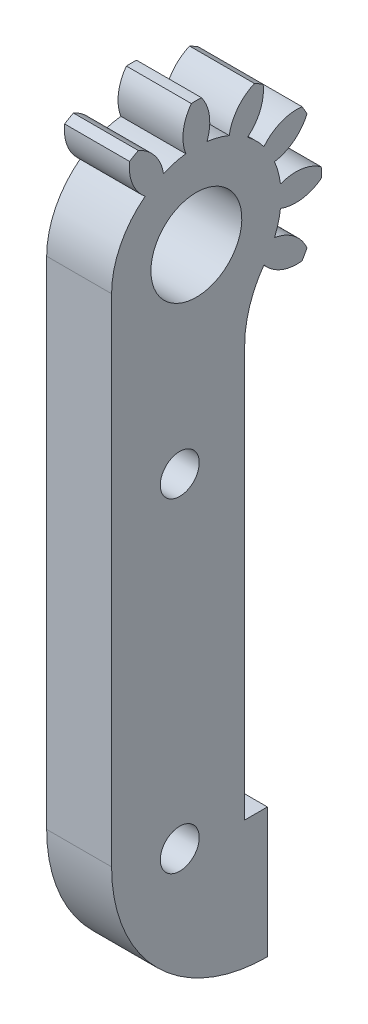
ISO-10303-21;
HEADER;
FILE_DESCRIPTION(('STEP AP214'),'2;1');
FILE_NAME('part.step','',(''),(''),'','','');
FILE_SCHEMA(('AUTOMOTIVE_DESIGN { 1 0 10303 214 1 1 1 1 }'));
ENDSEC;
DATA;
#1=APPLICATION_CONTEXT('core data for automotive mechanical design processes');
#2=APPLICATION_PROTOCOL_DEFINITION('international standard','automotive_design',2000,#1);
#3=PRODUCT_CONTEXT('',#1,'mechanical');
#4=PRODUCT('Part','Part','',(#3));
#5=PRODUCT_RELATED_PRODUCT_CATEGORY('part','',(#4));
#6=PRODUCT_DEFINITION_FORMATION('','',#4);
#7=PRODUCT_DEFINITION_CONTEXT('part definition',#1,'design');
#8=PRODUCT_DEFINITION('design','',#6,#7);
#9=PRODUCT_DEFINITION_SHAPE('','',#8);
#10=(LENGTH_UNIT() NAMED_UNIT(*) SI_UNIT(.MILLI.,.METRE.));
#11=(NAMED_UNIT(*) PLANE_ANGLE_UNIT() SI_UNIT($,.RADIAN.));
#12=(NAMED_UNIT(*) SI_UNIT($,.STERADIAN.) SOLID_ANGLE_UNIT());
#13=UNCERTAINTY_MEASURE_WITH_UNIT(LENGTH_MEASURE(1.E-05),#10,'distance_accuracy_value','');
#14=(GEOMETRIC_REPRESENTATION_CONTEXT(3) GLOBAL_UNCERTAINTY_ASSIGNED_CONTEXT((#13)) GLOBAL_UNIT_ASSIGNED_CONTEXT((#10,
#11,#12)) REPRESENTATION_CONTEXT('',''));
#15=CARTESIAN_POINT('',(0.,0.,0.));
#16=DIRECTION('',(0.,0.,1.));
#17=DIRECTION('',(1.,0.,0.));
#18=AXIS2_PLACEMENT_3D('',#15,#16,#17);
#19=CARTESIAN_POINT('',(2.81611238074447,0.23012666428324,-0.226197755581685));
#20=DIRECTION('',(-1.,0.,0.));
#21=DIRECTION('',(0.,-0.258819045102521,0.965925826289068));
#22=AXIS2_PLACEMENT_3D('',#19,#20,#21);
#23=CYLINDRICAL_SURFACE('',#22,6.53025);
#24=CARTESIAN_POINT('',(-2.18388761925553,0.23012666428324,-0.226197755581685));
#25=DIRECTION('',(-1.,0.,0.));
#26=DIRECTION('',(0.,0.707106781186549,-0.707106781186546));
#27=AXIS2_PLACEMENT_3D('',#24,#25,#26);
#28=CIRCLE('',#27,6.53025);
#29=CARTESIAN_POINT('',(-2.18388761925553,0.230126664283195,6.30405224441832));
#30=VERTEX_POINT('',#29);
#31=CARTESIAN_POINT('',(-2.18388761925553,5.43320069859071,3.71996312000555));
#32=VERTEX_POINT('',#31);
#33=EDGE_CURVE('E251',#30,#32,#28,.T.);
#34=ORIENTED_EDGE('',*,*,#33,.F.);
#35=DIRECTION('',(1.,0.,0.));
#36=VECTOR('',#35,1.);
#37=CARTESIAN_POINT('',(-53.8275283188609,0.230126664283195,6.30405224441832));
#38=LINE('',#37,#36);
#39=CARTESIAN_POINT('',(2.81611238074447,0.230126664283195,6.30405224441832));
#40=VERTEX_POINT('',#39);
#41=EDGE_CURVE('E236',#30,#40,#38,.T.);
#42=ORIENTED_EDGE('',*,*,#41,.T.);
#43=CARTESIAN_POINT('',(2.81611238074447,0.23012666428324,-0.226197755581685));
#44=DIRECTION('',(-1.,0.,0.));
#45=DIRECTION('',(0.,0.707106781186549,-0.707106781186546));
#46=AXIS2_PLACEMENT_3D('',#43,#44,#45);
#47=CIRCLE('',#46,6.53025);
#48=CARTESIAN_POINT('',(2.81611238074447,5.43320069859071,3.71996312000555));
#49=VERTEX_POINT('',#48);
#50=EDGE_CURVE('E249',#40,#49,#47,.T.);
#51=ORIENTED_EDGE('',*,*,#50,.T.);
#52=DIRECTION('',(-1.,0.,0.));
#53=VECTOR('',#52,1.);
#54=CARTESIAN_POINT('',(2.81611238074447,5.43320069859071,3.71996312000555));
#55=LINE('',#54,#53);
#56=EDGE_CURVE('E257',#49,#32,#55,.T.);
#57=ORIENTED_EDGE('',*,*,#56,.T.);
#58=EDGE_LOOP('',(#34,#42,#51,#57));
#59=FACE_BOUND('',#58,.T.);
#60=ADVANCED_FACE('F33',(#59),#23,.T.);
#61=CARTESIAN_POINT('',(2.81611238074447,0.23012666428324,-0.226197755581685));
#62=DIRECTION('',(-1.,0.,0.));
#63=DIRECTION('',(0.,-0.258819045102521,0.965925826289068));
#64=AXIS2_PLACEMENT_3D('',#61,#62,#63);
#65=PLANE('',#64);
#66=CARTESIAN_POINT('',(2.81611238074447,-14.4107973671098,1.05405224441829));
#67=DIRECTION('',(-1.,0.,0.));
#68=DIRECTION('',(0.,0.,1.));
#69=AXIS2_PLACEMENT_3D('',#66,#67,#68);
#70=CIRCLE('',#69,1.50000000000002);
#71=CARTESIAN_POINT('',(2.81611238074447,-14.4107973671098,2.55405224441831));
#72=VERTEX_POINT('',#71);
#73=EDGE_CURVE('E822',#72,#72,#70,.F.);
#74=ORIENTED_EDGE('',*,*,#73,.F.);
#75=EDGE_LOOP('',(#74));
#76=FACE_BOUND('',#75,.T.);
#77=CARTESIAN_POINT('',(2.81611238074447,-39.4107973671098,1.05405224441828));
#78=DIRECTION('',(-1.,0.,0.));
#79=DIRECTION('',(0.,0.,1.));
#80=AXIS2_PLACEMENT_3D('',#77,#78,#79);
#81=CIRCLE('',#80,1.50000000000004);
#82=CARTESIAN_POINT('',(2.81611238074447,-39.4107973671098,2.55405224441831));
#83=VERTEX_POINT('',#82);
#84=EDGE_CURVE('E245',#83,#83,#81,.F.);
#85=ORIENTED_EDGE('',*,*,#84,.F.);
#86=EDGE_LOOP('',(#85));
#87=FACE_BOUND('',#86,.T.);
#88=CARTESIAN_POINT('',(2.81611238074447,0.23012666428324,-0.226197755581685));
#89=DIRECTION('',(-1.,0.,0.));
#90=DIRECTION('',(0.,-0.258819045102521,0.965925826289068));
#91=AXIS2_PLACEMENT_3D('',#88,#89,#90);
#92=CIRCLE('',#91,3.5);
#93=CARTESIAN_POINT('',(2.81611238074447,-0.675739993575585,3.15454263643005));
#94=VERTEX_POINT('',#93);
#95=EDGE_CURVE('E449',#94,#94,#92,.F.);
#96=ORIENTED_EDGE('',*,*,#95,.F.);
#97=EDGE_LOOP('',(#96));
#98=FACE_BOUND('',#97,.T.);
#99=ORIENTED_EDGE('',*,*,#50,.F.);
#100=DIRECTION('',(0.,-1.,0.));
#101=VECTOR('',#100,1.);
#102=CARTESIAN_POINT('',(2.81611238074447,0.230126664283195,6.30405224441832));
#103=LINE('',#102,#101);
#104=CARTESIAN_POINT('',(2.81611238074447,-38.,6.30405224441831));
#105=VERTEX_POINT('',#104);
#106=EDGE_CURVE('E232',#40,#105,#103,.T.);
#107=ORIENTED_EDGE('',*,*,#106,.T.);
#108=CARTESIAN_POINT('',(2.81611238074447,-38.,-5.69594775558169));
#109=DIRECTION('',(1.,0.,0.));
#110=DIRECTION('',(0.,0.,-1.));
#111=AXIS2_PLACEMENT_3D('',#108,#109,#110);
#112=CIRCLE('',#111,12.);
#113=CARTESIAN_POINT('',(2.81611238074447,-50.,-5.69594775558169));
#114=VERTEX_POINT('',#113);
#115=EDGE_CURVE('E244',#105,#114,#112,.T.);
#116=ORIENTED_EDGE('',*,*,#115,.T.);
#117=DIRECTION('',(0.,1.,0.));
#118=VECTOR('',#117,1.);
#119=CARTESIAN_POINT('',(2.81611238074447,-40.,-5.69594775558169));
#120=LINE('',#119,#118);
#121=CARTESIAN_POINT('',(2.81611238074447,-40.,-5.69594775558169));
#122=VERTEX_POINT('',#121);
#123=EDGE_CURVE('E839',#114,#122,#120,.T.);
#124=ORIENTED_EDGE('',*,*,#123,.T.);
#125=DIRECTION('',(0.,0.,1.));
#126=VECTOR('',#125,1.);
#127=CARTESIAN_POINT('',(2.81611238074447,-40.,-3.94594775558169));
#128=LINE('',#127,#126);
#129=CARTESIAN_POINT('',(2.81611238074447,-40.,-3.94594775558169));
#130=VERTEX_POINT('',#129);
#131=EDGE_CURVE('E842',#122,#130,#128,.T.);
#132=ORIENTED_EDGE('',*,*,#131,.T.);
#133=DIRECTION('',(0.,1.,0.));
#134=VECTOR('',#133,1.);
#135=CARTESIAN_POINT('',(2.81611238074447,-40.,-3.94594775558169));
#136=LINE('',#135,#134);
#137=CARTESIAN_POINT('',(2.81611238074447,-8.35639350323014,-3.94594775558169));
#138=VERTEX_POINT('',#137);
#139=EDGE_CURVE('E845',#130,#138,#136,.T.);
#140=ORIENTED_EDGE('',*,*,#139,.T.);
#141=CARTESIAN_POINT('',(2.81611238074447,-8.35639350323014,-11.9459477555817));
#142=DIRECTION('',(-1.,0.,0.));
#143=DIRECTION('',(0.,0.,1.));
#144=AXIS2_PLACEMENT_3D('',#141,#142,#143);
#145=CIRCLE('',#144,8.);
#146=CARTESIAN_POINT('',(2.81611238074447,-3.71603421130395,-5.42927178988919));
#147=VERTEX_POINT('',#146);
#148=EDGE_CURVE('E252',#138,#147,#145,.T.);
#149=ORIENTED_EDGE('',*,*,#148,.T.);
#150=CARTESIAN_POINT('',(2.81611238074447,-1.63710295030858,-7.99209148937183));
#151=DIRECTION('',(-1.,0.,0.));
#152=DIRECTION('',(0.,-0.707106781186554,0.707106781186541));
#153=AXIS2_PLACEMENT_3D('',#150,#151,#152);
#154=CIRCLE('',#153,3.3);
#155=CARTESIAN_POINT('',(2.81611238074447,-4.91657616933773,-8.35959034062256));
#156=VERTEX_POINT('',#155);
#157=EDGE_CURVE('E374',#156,#147,#154,.T.);
#158=ORIENTED_EDGE('',*,*,#157,.F.);
#159=CARTESIAN_POINT('',(2.81611238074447,0.23012666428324,-0.226197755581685));
#160=DIRECTION('',(-1.,0.,0.));
#161=DIRECTION('',(0.,-0.258819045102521,0.965925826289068));
#162=AXIS2_PLACEMENT_3D('',#159,#160,#161);
#163=CIRCLE('',#162,9.625);
#164=CARTESIAN_POINT('',(2.81611238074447,-4.2402465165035,-8.75006944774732));
#165=VERTEX_POINT('',#164);
#166=EDGE_CURVE('E304',#165,#156,#163,.T.);
#167=ORIENTED_EDGE('',*,*,#166,.F.);
#168=CARTESIAN_POINT('',(2.81611238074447,-5.56171978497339,-5.72621290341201));
#169=DIRECTION('',(-1.,0.,0.));
#170=DIRECTION('',(0.,-0.965925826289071,0.258819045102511));
#171=AXIS2_PLACEMENT_3D('',#168,#169,#170);
#172=CIRCLE('',#171,3.3);
#173=CARTESIAN_POINT('',(2.81611238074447,-2.30278718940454,-6.24521033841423));
#174=VERTEX_POINT('',#173);
#175=EDGE_CURVE('E371',#174,#165,#172,.T.);
#176=ORIENTED_EDGE('',*,*,#175,.F.);
#177=CARTESIAN_POINT('',(2.81611238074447,0.23012666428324,-0.226197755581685));
#178=DIRECTION('',(-1.,0.,0.));
#179=DIRECTION('',(0.,-0.965925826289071,0.258819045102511));
#180=AXIS2_PLACEMENT_3D('',#177,#178,#179);
#181=CIRCLE('',#180,6.53025);
#182=CARTESIAN_POINT('',(2.81611238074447,-0.585811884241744,-6.70527248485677));
#183=VERTEX_POINT('',#182);
#184=EDGE_CURVE('E461',#183,#174,#181,.T.);
#185=ORIENTED_EDGE('',*,*,#184,.F.);
#186=CARTESIAN_POINT('',(2.81611238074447,2.49600525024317,-7.88527381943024));
#187=DIRECTION('',(-1.,0.,0.));
#188=DIRECTION('',(0.,-0.965925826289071,0.258819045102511));
#189=AXIS2_PLACEMENT_3D('',#186,#187,#188);
#190=CIRCLE('',#189,3.3);
#191=CARTESIAN_POINT('',(2.81611238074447,-0.160352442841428,-9.84327376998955));
#192=VERTEX_POINT('',#191);
#193=EDGE_CURVE('E458',#192,#183,#190,.T.);
#194=ORIENTED_EDGE('',*,*,#193,.F.);
#195=CARTESIAN_POINT('',(2.81611238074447,0.62060577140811,-9.84327376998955));
#196=VERTEX_POINT('',#195);
#197=EDGE_CURVE('E375',#196,#192,#163,.T.);
#198=ORIENTED_EDGE('',*,*,#197,.F.);
#199=CARTESIAN_POINT('',(2.81611238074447,-2.03575192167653,-7.88527381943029));
#200=DIRECTION('',(-1.,0.,0.));
#201=DIRECTION('',(0.,-0.965925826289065,-0.258819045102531));
#202=AXIS2_PLACEMENT_3D('',#199,#200,#201);
#203=CIRCLE('',#202,3.3);
#204=CARTESIAN_POINT('',(2.81611238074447,1.04606521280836,-6.70527248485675));
#205=VERTEX_POINT('',#204);
#206=EDGE_CURVE('E472',#205,#196,#203,.T.);
#207=ORIENTED_EDGE('',*,*,#206,.F.);
#208=CARTESIAN_POINT('',(2.81611238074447,0.23012666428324,-0.226197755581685));
#209=DIRECTION('',(-1.,0.,0.));
#210=DIRECTION('',(0.,-0.965925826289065,-0.258819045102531));
#211=AXIS2_PLACEMENT_3D('',#208,#209,#210);
#212=CIRCLE('',#211,6.53025);
#213=CARTESIAN_POINT('',(2.81611238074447,2.76304051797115,-6.24521033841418));
#214=VERTEX_POINT('',#213);
#215=EDGE_CURVE('E477',#214,#205,#212,.T.);
#216=ORIENTED_EDGE('',*,*,#215,.F.);
#217=CARTESIAN_POINT('',(2.81611238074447,6.02197311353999,-5.72621290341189));
#218=DIRECTION('',(-1.,0.,0.));
#219=DIRECTION('',(0.,-0.965925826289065,-0.258819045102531));
#220=AXIS2_PLACEMENT_3D('',#217,#218,#219);
#221=CIRCLE('',#220,3.3);
#222=CARTESIAN_POINT('',(2.81611238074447,4.70049984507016,-8.75006944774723));
#223=VERTEX_POINT('',#222);
#224=EDGE_CURVE('E474',#223,#214,#221,.T.);
#225=ORIENTED_EDGE('',*,*,#224,.F.);
#226=CARTESIAN_POINT('',(2.81611238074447,5.37682949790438,-8.35959034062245));
#227=VERTEX_POINT('',#226);
#228=EDGE_CURVE('E359',#227,#223,#163,.T.);
#229=ORIENTED_EDGE('',*,*,#228,.F.);
#230=CARTESIAN_POINT('',(2.81611238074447,2.09735627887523,-7.99209148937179));
#231=DIRECTION('',(-1.,0.,0.));
#232=DIRECTION('',(0.,-0.707106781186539,-0.707106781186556));
#233=AXIS2_PLACEMENT_3D('',#230,#231,#232);
#234=CIRCLE('',#233,3.3);
#235=CARTESIAN_POINT('',(2.81611238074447,4.17628753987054,-5.42927178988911));
#236=VERTEX_POINT('',#235);
#237=EDGE_CURVE('E397',#236,#227,#234,.T.);
#238=ORIENTED_EDGE('',*,*,#237,.F.);
#239=CARTESIAN_POINT('',(2.81611238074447,0.23012666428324,-0.226197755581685));
#240=DIRECTION('',(-1.,0.,0.));
#241=DIRECTION('',(0.,-0.707106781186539,-0.707106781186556));
#242=AXIS2_PLACEMENT_3D('',#239,#240,#241);
#243=CIRCLE('',#242,6.53025);
#244=CARTESIAN_POINT('',(2.81611238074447,5.43320069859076,-4.17235863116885));
#245=VERTEX_POINT('',#244);
#246=EDGE_CURVE('E394',#245,#236,#243,.T.);
#247=ORIENTED_EDGE('',*,*,#246,.F.);
#248=CARTESIAN_POINT('',(2.81611238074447,7.99602039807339,-2.09342737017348));
#249=DIRECTION('',(-1.,0.,0.));
#250=DIRECTION('',(0.,-0.707106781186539,-0.707106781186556));
#251=AXIS2_PLACEMENT_3D('',#248,#249,#250);
#252=CIRCLE('',#251,3.3);
#253=CARTESIAN_POINT('',(2.81611238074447,8.36351924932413,-5.37290058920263));
#254=VERTEX_POINT('',#253);
#255=EDGE_CURVE('E392',#254,#245,#252,.T.);
#256=ORIENTED_EDGE('',*,*,#255,.F.);
#257=CARTESIAN_POINT('',(2.81611238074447,8.75399835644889,-4.69657093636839));
#258=VERTEX_POINT('',#257);
#259=EDGE_CURVE('E303',#258,#254,#163,.T.);
#260=ORIENTED_EDGE('',*,*,#259,.F.);
#261=CARTESIAN_POINT('',(2.81611238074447,5.73014181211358,-6.0180442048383));
#262=DIRECTION('',(-1.,0.,0.));
#263=DIRECTION('',(0.,-0.258819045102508,-0.965925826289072));
#264=AXIS2_PLACEMENT_3D('',#261,#262,#263);
#265=CIRCLE('',#264,3.3);
#266=CARTESIAN_POINT('',(2.81611238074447,6.2491392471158,-2.75911160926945));
#267=VERTEX_POINT('',#266);
#268=EDGE_CURVE('E390',#267,#258,#265,.T.);
#269=ORIENTED_EDGE('',*,*,#268,.F.);
#270=CARTESIAN_POINT('',(2.81611238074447,0.23012666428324,-0.226197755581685));
#271=DIRECTION('',(-1.,0.,0.));
#272=DIRECTION('',(0.,-0.258819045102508,-0.965925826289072));
#273=AXIS2_PLACEMENT_3D('',#270,#271,#272);
#274=CIRCLE('',#273,6.53025);
#275=CARTESIAN_POINT('',(2.81611238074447,6.70920139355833,-1.04213630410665));
#276=VERTEX_POINT('',#275);
#277=EDGE_CURVE('E424',#276,#267,#274,.T.);
#278=ORIENTED_EDGE('',*,*,#277,.F.);
#279=CARTESIAN_POINT('',(2.81611238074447,7.88920272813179,2.03968083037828));
#280=DIRECTION('',(-1.,0.,0.));
#281=DIRECTION('',(0.,-0.258819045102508,-0.965925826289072));
#282=AXIS2_PLACEMENT_3D('',#279,#280,#281);
#283=CIRCLE('',#282,3.3);
#284=CARTESIAN_POINT('',(2.81611238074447,9.84720267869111,-0.616676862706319));
#285=VERTEX_POINT('',#284);
#286=EDGE_CURVE('E417',#285,#276,#283,.T.);
#287=ORIENTED_EDGE('',*,*,#286,.F.);
#288=CARTESIAN_POINT('',(2.81611238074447,9.8472026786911,0.164281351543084));
#289=VERTEX_POINT('',#288);
#290=EDGE_CURVE('E299',#289,#285,#163,.T.);
#291=ORIENTED_EDGE('',*,*,#290,.F.);
#292=CARTESIAN_POINT('',(2.81611238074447,7.88920272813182,-2.49207634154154));
#293=DIRECTION('',(-1.,0.,0.));
#294=DIRECTION('',(0.,0.258819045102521,-0.965925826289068));
#295=AXIS2_PLACEMENT_3D('',#292,#293,#294);
#296=CIRCLE('',#295,3.3);
#297=CARTESIAN_POINT('',(2.81611238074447,6.70920139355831,0.589740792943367));
#298=VERTEX_POINT('',#297);
#299=EDGE_CURVE('E271',#298,#289,#296,.T.);
#300=ORIENTED_EDGE('',*,*,#299,.F.);
#301=CARTESIAN_POINT('',(2.81611238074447,0.23012666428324,-0.226197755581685));
#302=DIRECTION('',(-1.,0.,0.));
#303=DIRECTION('',(0.,0.258819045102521,-0.965925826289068));
#304=AXIS2_PLACEMENT_3D('',#301,#302,#303);
#305=CIRCLE('',#304,6.53025);
#306=CARTESIAN_POINT('',(2.81611238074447,6.24913924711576,2.30671609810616));
#307=VERTEX_POINT('',#306);
#308=EDGE_CURVE('E276',#307,#298,#305,.T.);
#309=ORIENTED_EDGE('',*,*,#308,.F.);
#310=CARTESIAN_POINT('',(2.81611238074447,5.7301418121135,5.56564869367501));
#311=DIRECTION('',(-1.,0.,0.));
#312=DIRECTION('',(0.,0.258819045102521,-0.965925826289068));
#313=AXIS2_PLACEMENT_3D('',#310,#311,#312);
#314=CIRCLE('',#313,3.3);
#315=CARTESIAN_POINT('',(2.81611238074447,8.75399835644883,4.24417542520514));
#316=VERTEX_POINT('',#315);
#317=EDGE_CURVE('E273',#316,#307,#314,.T.);
#318=ORIENTED_EDGE('',*,*,#317,.F.);
#319=CARTESIAN_POINT('',(2.81611238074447,8.36351924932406,4.92050507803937));
#320=VERTEX_POINT('',#319);
#321=EDGE_CURVE('E296',#320,#316,#163,.T.);
#322=ORIENTED_EDGE('',*,*,#321,.F.);
#323=CARTESIAN_POINT('',(2.81611238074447,7.99602039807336,1.64103185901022));
#324=DIRECTION('',(-1.,0.,0.));
#325=DIRECTION('',(0.,0.707106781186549,-0.707106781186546));
#326=AXIS2_PLACEMENT_3D('',#323,#324,#325);
#327=CIRCLE('',#326,3.3);
#328=EDGE_CURVE('E256',#49,#320,#327,.T.);
#329=ORIENTED_EDGE('',*,*,#328,.F.);
#330=EDGE_LOOP('',(#99,#107,#116,#124,#132,#140,#149,#158,#167,#176,#185,#194,#198,#207,#216,
#225,#229,#238,#247,#256,#260,#269,#278,#287,#291,#300,#309,#318,#322,#329));
#331=FACE_BOUND('',#330,.T.);
#332=ADVANCED_FACE('F35',(#76,#87,#98,#331),#65,.F.);
#333=CARTESIAN_POINT('',(-2.18388761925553,0.23012666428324,-0.226197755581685));
#334=DIRECTION('',(1.,0.,0.));
#335=DIRECTION('',(0.,0.258819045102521,-0.965925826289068));
#336=AXIS2_PLACEMENT_3D('',#333,#334,#335);
#337=PLANE('',#336);
#338=CARTESIAN_POINT('',(-2.18388761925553,-14.4107973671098,1.05405224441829));
#339=DIRECTION('',(-1.,0.,0.));
#340=DIRECTION('',(0.,0.,1.));
#341=AXIS2_PLACEMENT_3D('',#338,#339,#340);
#342=CIRCLE('',#341,1.50000000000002);
#343=CARTESIAN_POINT('',(-2.18388761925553,-14.4107973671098,2.55405224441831));
#344=VERTEX_POINT('',#343);
#345=EDGE_CURVE('E819',#344,#344,#342,.T.);
#346=ORIENTED_EDGE('',*,*,#345,.F.);
#347=EDGE_LOOP('',(#346));
#348=FACE_BOUND('',#347,.T.);
#349=CARTESIAN_POINT('',(-2.18388761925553,-39.4107973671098,1.05405224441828));
#350=DIRECTION('',(-1.,0.,0.));
#351=DIRECTION('',(0.,0.,1.));
#352=AXIS2_PLACEMENT_3D('',#349,#350,#351);
#353=CIRCLE('',#352,1.50000000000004);
#354=CARTESIAN_POINT('',(-2.18388761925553,-39.4107973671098,2.55405224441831));
#355=VERTEX_POINT('',#354);
#356=EDGE_CURVE('E824',#355,#355,#353,.T.);
#357=ORIENTED_EDGE('',*,*,#356,.F.);
#358=EDGE_LOOP('',(#357));
#359=FACE_BOUND('',#358,.T.);
#360=CARTESIAN_POINT('',(-2.18388761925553,0.23012666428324,-0.226197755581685));
#361=DIRECTION('',(1.,0.,0.));
#362=DIRECTION('',(0.,0.258819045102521,-0.965925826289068));
#363=AXIS2_PLACEMENT_3D('',#360,#361,#362);
#364=CIRCLE('',#363,3.5);
#365=CARTESIAN_POINT('',(-2.18388761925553,1.13599332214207,-3.60693814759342));
#366=VERTEX_POINT('',#365);
#367=EDGE_CURVE('E37',#366,#366,#364,.F.);
#368=ORIENTED_EDGE('',*,*,#367,.F.);
#369=EDGE_LOOP('',(#368));
#370=FACE_BOUND('',#369,.T.);
#371=CARTESIAN_POINT('',(-2.18388761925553,-1.63710295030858,-7.99209148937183));
#372=DIRECTION('',(1.,0.,0.));
#373=DIRECTION('',(0.,0.258819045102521,-0.965925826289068));
#374=AXIS2_PLACEMENT_3D('',#371,#372,#373);
#375=CIRCLE('',#374,3.3);
#376=CARTESIAN_POINT('',(-2.18388761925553,-3.71603421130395,-5.42927178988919));
#377=VERTEX_POINT('',#376);
#378=CARTESIAN_POINT('',(-2.18388761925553,-4.91657616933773,-8.35959034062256));
#379=VERTEX_POINT('',#378);
#380=EDGE_CURVE('E42',#377,#379,#375,.T.);
#381=ORIENTED_EDGE('',*,*,#380,.F.);
#382=CARTESIAN_POINT('',(-2.18388761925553,-8.35639350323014,-11.9459477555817));
#383=DIRECTION('',(1.,0.,0.));
#384=DIRECTION('',(0.,0.,-1.));
#385=AXIS2_PLACEMENT_3D('',#382,#383,#384);
#386=CIRCLE('',#385,8.);
#387=CARTESIAN_POINT('',(-2.18388761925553,-8.35639350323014,-3.94594775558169));
#388=VERTEX_POINT('',#387);
#389=EDGE_CURVE('E446',#377,#388,#386,.T.);
#390=ORIENTED_EDGE('',*,*,#389,.T.);
#391=DIRECTION('',(0.,-1.,0.));
#392=VECTOR('',#391,1.);
#393=CARTESIAN_POINT('',(-2.18388761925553,-40.,-3.94594775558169));
#394=LINE('',#393,#392);
#395=CARTESIAN_POINT('',(-2.18388761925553,-40.,-3.94594775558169));
#396=VERTEX_POINT('',#395);
#397=EDGE_CURVE('E450',#388,#396,#394,.T.);
#398=ORIENTED_EDGE('',*,*,#397,.T.);
#399=DIRECTION('',(0.,0.,-1.));
#400=VECTOR('',#399,1.);
#401=CARTESIAN_POINT('',(-2.18388761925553,-40.,-3.94594775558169));
#402=LINE('',#401,#400);
#403=CARTESIAN_POINT('',(-2.18388761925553,-40.,-5.69594775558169));
#404=VERTEX_POINT('',#403);
#405=EDGE_CURVE('E835',#396,#404,#402,.T.);
#406=ORIENTED_EDGE('',*,*,#405,.T.);
#407=DIRECTION('',(0.,-1.,0.));
#408=VECTOR('',#407,1.);
#409=CARTESIAN_POINT('',(-2.18388761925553,-40.,-5.69594775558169));
#410=LINE('',#409,#408);
#411=CARTESIAN_POINT('',(-2.18388761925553,-50.,-5.69594775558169));
#412=VERTEX_POINT('',#411);
#413=EDGE_CURVE('E832',#404,#412,#410,.T.);
#414=ORIENTED_EDGE('',*,*,#413,.T.);
#415=CARTESIAN_POINT('',(-2.18388761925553,-38.,-5.69594775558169));
#416=DIRECTION('',(1.,0.,0.));
#417=DIRECTION('',(0.,0.,-1.));
#418=AXIS2_PLACEMENT_3D('',#415,#416,#417);
#419=CIRCLE('',#418,12.);
#420=CARTESIAN_POINT('',(-2.18388761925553,-38.,6.30405224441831));
#421=VERTEX_POINT('',#420);
#422=EDGE_CURVE('E445',#412,#421,#419,.F.);
#423=ORIENTED_EDGE('',*,*,#422,.T.);
#424=DIRECTION('',(0.,1.,0.));
#425=VECTOR('',#424,1.);
#426=CARTESIAN_POINT('',(-2.18388761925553,0.230126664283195,6.30405224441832));
#427=LINE('',#426,#425);
#428=EDGE_CURVE('E443',#421,#30,#427,.T.);
#429=ORIENTED_EDGE('',*,*,#428,.T.);
#430=ORIENTED_EDGE('',*,*,#33,.T.);
#431=CARTESIAN_POINT('',(-2.18388761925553,7.99602039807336,1.64103185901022));
#432=DIRECTION('',(-1.,0.,0.));
#433=DIRECTION('',(0.,0.707106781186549,-0.707106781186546));
#434=AXIS2_PLACEMENT_3D('',#431,#432,#433);
#435=CIRCLE('',#434,3.3);
#436=CARTESIAN_POINT('',(-2.18388761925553,8.36351924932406,4.92050507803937));
#437=VERTEX_POINT('',#436);
#438=EDGE_CURVE('E264',#32,#437,#435,.T.);
#439=ORIENTED_EDGE('',*,*,#438,.T.);
#440=CARTESIAN_POINT('',(-2.18388761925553,0.23012666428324,-0.226197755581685));
#441=DIRECTION('',(-1.,0.,0.));
#442=DIRECTION('',(0.,-0.258819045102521,0.965925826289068));
#443=AXIS2_PLACEMENT_3D('',#440,#441,#442);
#444=CIRCLE('',#443,9.625);
#445=CARTESIAN_POINT('',(-2.18388761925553,8.75399835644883,4.24417542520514));
#446=VERTEX_POINT('',#445);
#447=EDGE_CURVE('E292',#437,#446,#444,.T.);
#448=ORIENTED_EDGE('',*,*,#447,.T.);
#449=CARTESIAN_POINT('',(-2.18388761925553,5.7301418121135,5.56564869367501));
#450=DIRECTION('',(1.,0.,0.));
#451=DIRECTION('',(0.,0.258819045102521,-0.965925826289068));
#452=AXIS2_PLACEMENT_3D('',#449,#450,#451);
#453=CIRCLE('',#452,3.3);
#454=CARTESIAN_POINT('',(-2.18388761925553,6.24913924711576,2.30671609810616));
#455=VERTEX_POINT('',#454);
#456=EDGE_CURVE('E302',#455,#446,#453,.T.);
#457=ORIENTED_EDGE('',*,*,#456,.F.);
#458=CARTESIAN_POINT('',(-2.18388761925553,0.23012666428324,-0.226197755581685));
#459=DIRECTION('',(-1.,0.,0.));
#460=DIRECTION('',(0.,0.258819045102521,-0.965925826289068));
#461=AXIS2_PLACEMENT_3D('',#458,#459,#460);
#462=CIRCLE('',#461,6.53025);
#463=CARTESIAN_POINT('',(-2.18388761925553,6.70920139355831,0.589740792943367));
#464=VERTEX_POINT('',#463);
#465=EDGE_CURVE('E274',#455,#464,#462,.T.);
#466=ORIENTED_EDGE('',*,*,#465,.T.);
#467=CARTESIAN_POINT('',(-2.18388761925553,7.88920272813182,-2.49207634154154));
#468=DIRECTION('',(-1.,0.,0.));
#469=DIRECTION('',(0.,0.258819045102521,-0.965925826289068));
#470=AXIS2_PLACEMENT_3D('',#467,#468,#469);
#471=CIRCLE('',#470,3.3);
#472=CARTESIAN_POINT('',(-2.18388761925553,9.8472026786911,0.164281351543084));
#473=VERTEX_POINT('',#472);
#474=EDGE_CURVE('E270',#464,#473,#471,.T.);
#475=ORIENTED_EDGE('',*,*,#474,.T.);
#476=CARTESIAN_POINT('',(-2.18388761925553,9.84720267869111,-0.616676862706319));
#477=VERTEX_POINT('',#476);
#478=EDGE_CURVE('E293',#473,#477,#444,.T.);
#479=ORIENTED_EDGE('',*,*,#478,.T.);
#480=CARTESIAN_POINT('',(-2.18388761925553,7.88920272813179,2.03968083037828));
#481=DIRECTION('',(1.,0.,0.));
#482=DIRECTION('',(0.,0.258819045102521,-0.965925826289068));
#483=AXIS2_PLACEMENT_3D('',#480,#481,#482);
#484=CIRCLE('',#483,3.3);
#485=CARTESIAN_POINT('',(-2.18388761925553,6.70920139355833,-1.04213630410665));
#486=VERTEX_POINT('',#485);
#487=EDGE_CURVE('E309',#486,#477,#484,.T.);
#488=ORIENTED_EDGE('',*,*,#487,.F.);
#489=CARTESIAN_POINT('',(-2.18388761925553,0.23012666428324,-0.226197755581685));
#490=DIRECTION('',(-1.,0.,0.));
#491=DIRECTION('',(0.,-0.258819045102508,-0.965925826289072));
#492=AXIS2_PLACEMENT_3D('',#489,#490,#491);
#493=CIRCLE('',#492,6.53025);
#494=CARTESIAN_POINT('',(-2.18388761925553,6.2491392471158,-2.75911160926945));
#495=VERTEX_POINT('',#494);
#496=EDGE_CURVE('E484',#486,#495,#493,.T.);
#497=ORIENTED_EDGE('',*,*,#496,.T.);
#498=CARTESIAN_POINT('',(-2.18388761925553,5.73014181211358,-6.0180442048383));
#499=DIRECTION('',(-1.,0.,0.));
#500=DIRECTION('',(0.,-0.258819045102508,-0.965925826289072));
#501=AXIS2_PLACEMENT_3D('',#498,#499,#500);
#502=CIRCLE('',#501,3.3);
#503=CARTESIAN_POINT('',(-2.18388761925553,8.75399835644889,-4.69657093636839));
#504=VERTEX_POINT('',#503);
#505=EDGE_CURVE('E456',#495,#504,#502,.T.);
#506=ORIENTED_EDGE('',*,*,#505,.T.);
#507=CARTESIAN_POINT('',(-2.18388761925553,8.36351924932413,-5.37290058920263));
#508=VERTEX_POINT('',#507);
#509=EDGE_CURVE('E297',#504,#508,#444,.T.);
#510=ORIENTED_EDGE('',*,*,#509,.T.);
#511=CARTESIAN_POINT('',(-2.18388761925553,7.99602039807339,-2.09342737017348));
#512=DIRECTION('',(1.,0.,0.));
#513=DIRECTION('',(0.,0.258819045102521,-0.965925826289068));
#514=AXIS2_PLACEMENT_3D('',#511,#512,#513);
#515=CIRCLE('',#514,3.3);
#516=CARTESIAN_POINT('',(-2.18388761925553,5.43320069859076,-4.17235863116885));
#517=VERTEX_POINT('',#516);
#518=EDGE_CURVE('E307',#517,#508,#515,.T.);
#519=ORIENTED_EDGE('',*,*,#518,.F.);
#520=CARTESIAN_POINT('',(-2.18388761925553,0.23012666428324,-0.226197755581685));
#521=DIRECTION('',(-1.,0.,0.));
#522=DIRECTION('',(0.,-0.707106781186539,-0.707106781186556));
#523=AXIS2_PLACEMENT_3D('',#520,#521,#522);
#524=CIRCLE('',#523,6.53025);
#525=CARTESIAN_POINT('',(-2.18388761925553,4.17628753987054,-5.42927178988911));
#526=VERTEX_POINT('',#525);
#527=EDGE_CURVE('E401',#517,#526,#524,.T.);
#528=ORIENTED_EDGE('',*,*,#527,.T.);
#529=CARTESIAN_POINT('',(-2.18388761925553,2.09735627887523,-7.99209148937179));
#530=DIRECTION('',(-1.,0.,0.));
#531=DIRECTION('',(0.,-0.707106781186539,-0.707106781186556));
#532=AXIS2_PLACEMENT_3D('',#529,#530,#531);
#533=CIRCLE('',#532,3.3);
#534=CARTESIAN_POINT('',(-2.18388761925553,5.37682949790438,-8.35959034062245));
#535=VERTEX_POINT('',#534);
#536=EDGE_CURVE('E350',#526,#535,#533,.T.);
#537=ORIENTED_EDGE('',*,*,#536,.T.);
#538=CARTESIAN_POINT('',(-2.18388761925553,4.70049984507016,-8.75006944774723));
#539=VERTEX_POINT('',#538);
#540=EDGE_CURVE('E337',#535,#539,#444,.T.);
#541=ORIENTED_EDGE('',*,*,#540,.T.);
#542=CARTESIAN_POINT('',(-2.18388761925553,6.02197311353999,-5.72621290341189));
#543=DIRECTION('',(1.,0.,0.));
#544=DIRECTION('',(0.,0.258819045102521,-0.965925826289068));
#545=AXIS2_PLACEMENT_3D('',#542,#543,#544);
#546=CIRCLE('',#545,3.3);
#547=CARTESIAN_POINT('',(-2.18388761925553,2.76304051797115,-6.24521033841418));
#548=VERTEX_POINT('',#547);
#549=EDGE_CURVE('E311',#548,#539,#546,.T.);
#550=ORIENTED_EDGE('',*,*,#549,.F.);
#551=CARTESIAN_POINT('',(-2.18388761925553,0.23012666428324,-0.226197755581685));
#552=DIRECTION('',(-1.,0.,0.));
#553=DIRECTION('',(0.,-0.965925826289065,-0.258819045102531));
#554=AXIS2_PLACEMENT_3D('',#551,#552,#553);
#555=CIRCLE('',#554,6.53025);
#556=CARTESIAN_POINT('',(-2.18388761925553,1.04606521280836,-6.70527248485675));
#557=VERTEX_POINT('',#556);
#558=EDGE_CURVE('E475',#548,#557,#555,.T.);
#559=ORIENTED_EDGE('',*,*,#558,.T.);
#560=CARTESIAN_POINT('',(-2.18388761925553,-2.03575192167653,-7.88527381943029));
#561=DIRECTION('',(-1.,0.,0.));
#562=DIRECTION('',(0.,-0.965925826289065,-0.258819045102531));
#563=AXIS2_PLACEMENT_3D('',#560,#561,#562);
#564=CIRCLE('',#563,3.3);
#565=CARTESIAN_POINT('',(-2.18388761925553,0.620605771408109,-9.84327376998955));
#566=VERTEX_POINT('',#565);
#567=EDGE_CURVE('E57',#557,#566,#564,.T.);
#568=ORIENTED_EDGE('',*,*,#567,.T.);
#569=CARTESIAN_POINT('',(-2.18388761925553,-0.160352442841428,-9.84327376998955));
#570=VERTEX_POINT('',#569);
#571=EDGE_CURVE('E335',#566,#570,#444,.T.);
#572=ORIENTED_EDGE('',*,*,#571,.T.);
#573=CARTESIAN_POINT('',(-2.18388761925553,2.49600525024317,-7.88527381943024));
#574=DIRECTION('',(1.,0.,0.));
#575=DIRECTION('',(0.,0.258819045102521,-0.965925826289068));
#576=AXIS2_PLACEMENT_3D('',#573,#574,#575);
#577=CIRCLE('',#576,3.3);
#578=CARTESIAN_POINT('',(-2.18388761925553,-0.585811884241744,-6.70527248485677));
#579=VERTEX_POINT('',#578);
#580=EDGE_CURVE('E11',#579,#570,#577,.T.);
#581=ORIENTED_EDGE('',*,*,#580,.F.);
#582=CARTESIAN_POINT('',(-2.18388761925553,0.23012666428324,-0.226197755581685));
#583=DIRECTION('',(-1.,0.,0.));
#584=DIRECTION('',(0.,-0.965925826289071,0.258819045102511));
#585=AXIS2_PLACEMENT_3D('',#582,#583,#584);
#586=CIRCLE('',#585,6.53025);
#587=CARTESIAN_POINT('',(-2.18388761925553,-2.30278718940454,-6.24521033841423));
#588=VERTEX_POINT('',#587);
#589=EDGE_CURVE('E459',#579,#588,#586,.T.);
#590=ORIENTED_EDGE('',*,*,#589,.T.);
#591=CARTESIAN_POINT('',(-2.18388761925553,-5.56171978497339,-5.72621290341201));
#592=DIRECTION('',(-1.,0.,0.));
#593=DIRECTION('',(0.,-0.965925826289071,0.258819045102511));
#594=AXIS2_PLACEMENT_3D('',#591,#592,#593);
#595=CIRCLE('',#594,3.3);
#596=CARTESIAN_POINT('',(-2.18388761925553,-4.2402465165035,-8.75006944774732));
#597=VERTEX_POINT('',#596);
#598=EDGE_CURVE('E49',#588,#597,#595,.T.);
#599=ORIENTED_EDGE('',*,*,#598,.T.);
#600=EDGE_CURVE('E298',#597,#379,#444,.T.);
#601=ORIENTED_EDGE('',*,*,#600,.T.);
#602=EDGE_LOOP('',(#381,#390,#398,#406,#414,#423,#429,#430,#439,#448,#457,#466,#475,#479,#488,
#497,#506,#510,#519,#528,#537,#541,#550,#559,#568,#572,#581,#590,#599,#601));
#603=FACE_BOUND('',#602,.T.);
#604=ADVANCED_FACE('F333',(#348,#359,#370,#603),#337,.F.);
#605=CARTESIAN_POINT('',(-12.1838876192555,0.23012666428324,-0.226197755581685));
#606=DIRECTION('',(-1.,0.,0.));
#607=DIRECTION('',(0.,-0.258819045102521,0.965925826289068));
#608=AXIS2_PLACEMENT_3D('',#605,#606,#607);
#609=CYLINDRICAL_SURFACE('',#608,9.625);
#610=DIRECTION('',(-1.,0.,0.));
#611=VECTOR('',#610,1.);
#612=CARTESIAN_POINT('',(0.316112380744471,-4.2402465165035,-8.75006944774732));
#613=LINE('',#612,#611);
#614=EDGE_CURVE('E267',#165,#597,#613,.T.);
#615=ORIENTED_EDGE('',*,*,#614,.F.);
#616=ORIENTED_EDGE('',*,*,#166,.T.);
#617=DIRECTION('',(-1.,0.,0.));
#618=VECTOR('',#617,1.);
#619=CARTESIAN_POINT('',(0.316112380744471,-4.91657616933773,-8.35959034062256));
#620=LINE('',#619,#618);
#621=EDGE_CURVE('E319',#379,#156,#620,.F.);
#622=ORIENTED_EDGE('',*,*,#621,.F.);
#623=ORIENTED_EDGE('',*,*,#600,.F.);
#624=EDGE_LOOP('',(#615,#616,#622,#623));
#625=FACE_BOUND('',#624,.T.);
#626=ADVANCED_FACE('F328',(#625),#609,.T.);
#627=DIRECTION('',(-1.,0.,0.));
#628=VECTOR('',#627,1.);
#629=CARTESIAN_POINT('',(0.316112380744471,-0.160352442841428,-9.84327376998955));
#630=LINE('',#629,#628);
#631=EDGE_CURVE('E330',#570,#192,#630,.F.);
#632=ORIENTED_EDGE('',*,*,#631,.F.);
#633=ORIENTED_EDGE('',*,*,#571,.F.);
#634=DIRECTION('',(-1.,0.,0.));
#635=VECTOR('',#634,1.);
#636=CARTESIAN_POINT('',(0.316112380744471,0.620605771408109,-9.84327376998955));
#637=LINE('',#636,#635);
#638=EDGE_CURVE('E331',#196,#566,#637,.T.);
#639=ORIENTED_EDGE('',*,*,#638,.F.);
#640=ORIENTED_EDGE('',*,*,#197,.T.);
#641=EDGE_LOOP('',(#632,#633,#639,#640));
#642=FACE_BOUND('',#641,.T.);
#643=ADVANCED_FACE('F535',(#642),#609,.T.);
#644=DIRECTION('',(-1.,0.,0.));
#645=VECTOR('',#644,1.);
#646=CARTESIAN_POINT('',(0.316112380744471,4.70049984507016,-8.75006944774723));
#647=LINE('',#646,#645);
#648=EDGE_CURVE('E358',#539,#223,#647,.F.);
#649=ORIENTED_EDGE('',*,*,#648,.F.);
#650=ORIENTED_EDGE('',*,*,#540,.F.);
#651=DIRECTION('',(-1.,0.,0.));
#652=VECTOR('',#651,1.);
#653=CARTESIAN_POINT('',(0.316112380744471,5.37682949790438,-8.35959034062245));
#654=LINE('',#653,#652);
#655=EDGE_CURVE('E356',#227,#535,#654,.T.);
#656=ORIENTED_EDGE('',*,*,#655,.F.);
#657=ORIENTED_EDGE('',*,*,#228,.T.);
#658=EDGE_LOOP('',(#649,#650,#656,#657));
#659=FACE_BOUND('',#658,.T.);
#660=ADVANCED_FACE('F354',(#659),#609,.T.);
#661=DIRECTION('',(-1.,0.,0.));
#662=VECTOR('',#661,1.);
#663=CARTESIAN_POINT('',(0.316112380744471,8.75399835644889,-4.69657093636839));
#664=LINE('',#663,#662);
#665=EDGE_CURVE('E362',#258,#504,#664,.T.);
#666=ORIENTED_EDGE('',*,*,#665,.F.);
#667=ORIENTED_EDGE('',*,*,#259,.T.);
#668=DIRECTION('',(-1.,0.,0.));
#669=VECTOR('',#668,1.);
#670=CARTESIAN_POINT('',(0.316112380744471,8.36351924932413,-5.37290058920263));
#671=LINE('',#670,#669);
#672=EDGE_CURVE('E386',#508,#254,#671,.F.);
#673=ORIENTED_EDGE('',*,*,#672,.F.);
#674=ORIENTED_EDGE('',*,*,#509,.F.);
#675=EDGE_LOOP('',(#666,#667,#673,#674));
#676=FACE_BOUND('',#675,.T.);
#677=ADVANCED_FACE('F385',(#676),#609,.T.);
#678=DIRECTION('',(-1.,0.,0.));
#679=VECTOR('',#678,1.);
#680=CARTESIAN_POINT('',(0.316112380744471,9.84720267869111,-0.616676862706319));
#681=LINE('',#680,#679);
#682=EDGE_CURVE('E365',#477,#285,#681,.F.);
#683=ORIENTED_EDGE('',*,*,#682,.F.);
#684=ORIENTED_EDGE('',*,*,#478,.F.);
#685=DIRECTION('',(-1.,0.,0.));
#686=VECTOR('',#685,1.);
#687=CARTESIAN_POINT('',(0.316112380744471,9.8472026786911,0.164281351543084));
#688=LINE('',#687,#686);
#689=EDGE_CURVE('E290',#289,#473,#688,.T.);
#690=ORIENTED_EDGE('',*,*,#689,.F.);
#691=ORIENTED_EDGE('',*,*,#290,.T.);
#692=EDGE_LOOP('',(#683,#684,#690,#691));
#693=FACE_BOUND('',#692,.T.);
#694=ADVANCED_FACE('F427',(#693),#609,.T.);
#695=DIRECTION('',(-1.,0.,0.));
#696=VECTOR('',#695,1.);
#697=CARTESIAN_POINT('',(0.316112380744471,8.36351924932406,4.92050507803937));
#698=LINE('',#697,#696);
#699=EDGE_CURVE('E259',#320,#437,#698,.T.);
#700=ORIENTED_EDGE('',*,*,#699,.F.);
#701=ORIENTED_EDGE('',*,*,#321,.T.);
#702=DIRECTION('',(-1.,0.,0.));
#703=VECTOR('',#702,1.);
#704=CARTESIAN_POINT('',(0.316112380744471,8.75399835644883,4.24417542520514));
#705=LINE('',#704,#703);
#706=EDGE_CURVE('E287',#446,#316,#705,.F.);
#707=ORIENTED_EDGE('',*,*,#706,.F.);
#708=ORIENTED_EDGE('',*,*,#447,.F.);
#709=EDGE_LOOP('',(#700,#701,#707,#708));
#710=FACE_BOUND('',#709,.T.);
#711=ADVANCED_FACE('F439',(#710),#609,.T.);
#712=CARTESIAN_POINT('',(2.81611238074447,7.88920272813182,-2.49207634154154));
#713=DIRECTION('',(-1.,0.,0.));
#714=DIRECTION('',(0.,-0.258819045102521,0.965925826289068));
#715=AXIS2_PLACEMENT_3D('',#712,#713,#714);
#716=CYLINDRICAL_SURFACE('',#715,3.3);
#717=ORIENTED_EDGE('',*,*,#689,.T.);
#718=ORIENTED_EDGE('',*,*,#474,.F.);
#719=DIRECTION('',(-1.,0.,0.));
#720=VECTOR('',#719,1.);
#721=CARTESIAN_POINT('',(2.81611238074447,6.70920139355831,0.589740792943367));
#722=LINE('',#721,#720);
#723=EDGE_CURVE('E278',#298,#464,#722,.T.);
#724=ORIENTED_EDGE('',*,*,#723,.F.);
#725=ORIENTED_EDGE('',*,*,#299,.T.);
#726=EDGE_LOOP('',(#717,#718,#724,#725));
#727=FACE_BOUND('',#726,.T.);
#728=ADVANCED_FACE('F429',(#727),#716,.T.);
#729=CARTESIAN_POINT('',(2.81611238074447,5.7301418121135,5.56564869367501));
#730=DIRECTION('',(-1.,0.,0.));
#731=DIRECTION('',(0.,-0.258819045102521,0.965925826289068));
#732=AXIS2_PLACEMENT_3D('',#729,#730,#731);
#733=CYLINDRICAL_SURFACE('',#732,3.3);
#734=ORIENTED_EDGE('',*,*,#706,.T.);
#735=ORIENTED_EDGE('',*,*,#317,.T.);
#736=DIRECTION('',(-1.,0.,0.));
#737=VECTOR('',#736,1.);
#738=CARTESIAN_POINT('',(2.81611238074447,6.24913924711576,2.30671609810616));
#739=LINE('',#738,#737);
#740=EDGE_CURVE('E285',#307,#455,#739,.T.);
#741=ORIENTED_EDGE('',*,*,#740,.T.);
#742=ORIENTED_EDGE('',*,*,#456,.T.);
#743=EDGE_LOOP('',(#734,#735,#741,#742));
#744=FACE_BOUND('',#743,.T.);
#745=ADVANCED_FACE('F438',(#744),#733,.T.);
#746=CARTESIAN_POINT('',(2.81611238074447,0.23012666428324,-0.226197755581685));
#747=DIRECTION('',(-1.,0.,0.));
#748=DIRECTION('',(0.,-0.258819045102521,0.965925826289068));
#749=AXIS2_PLACEMENT_3D('',#746,#747,#748);
#750=CYLINDRICAL_SURFACE('',#749,6.53025);
#751=ORIENTED_EDGE('',*,*,#465,.F.);
#752=ORIENTED_EDGE('',*,*,#740,.F.);
#753=ORIENTED_EDGE('',*,*,#308,.T.);
#754=ORIENTED_EDGE('',*,*,#723,.T.);
#755=EDGE_LOOP('',(#751,#752,#753,#754));
#756=FACE_BOUND('',#755,.T.);
#757=ADVANCED_FACE('F434',(#756),#750,.T.);
#758=CARTESIAN_POINT('',(2.81611238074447,7.99602039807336,1.64103185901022));
#759=DIRECTION('',(-1.,0.,0.));
#760=DIRECTION('',(0.,-0.258819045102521,0.965925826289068));
#761=AXIS2_PLACEMENT_3D('',#758,#759,#760);
#762=CYLINDRICAL_SURFACE('',#761,3.3);
#763=ORIENTED_EDGE('',*,*,#699,.T.);
#764=ORIENTED_EDGE('',*,*,#438,.F.);
#765=ORIENTED_EDGE('',*,*,#56,.F.);
#766=ORIENTED_EDGE('',*,*,#328,.T.);
#767=EDGE_LOOP('',(#763,#764,#765,#766));
#768=FACE_BOUND('',#767,.T.);
#769=ADVANCED_FACE('F442',(#768),#762,.T.);
#770=CARTESIAN_POINT('',(2.81611238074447,2.09735627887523,-7.99209148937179));
#771=DIRECTION('',(-1.,0.,0.));
#772=DIRECTION('',(0.,-0.258819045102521,0.965925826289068));
#773=AXIS2_PLACEMENT_3D('',#770,#771,#772);
#774=CYLINDRICAL_SURFACE('',#773,3.3);
#775=ORIENTED_EDGE('',*,*,#655,.T.);
#776=ORIENTED_EDGE('',*,*,#536,.F.);
#777=DIRECTION('',(-1.,0.,0.));
#778=VECTOR('',#777,1.);
#779=CARTESIAN_POINT('',(2.81611238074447,4.17628753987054,-5.42927178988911));
#780=LINE('',#779,#778);
#781=EDGE_CURVE('E399',#236,#526,#780,.T.);
#782=ORIENTED_EDGE('',*,*,#781,.F.);
#783=ORIENTED_EDGE('',*,*,#237,.T.);
#784=EDGE_LOOP('',(#775,#776,#782,#783));
#785=FACE_BOUND('',#784,.T.);
#786=ADVANCED_FACE('F518',(#785),#774,.T.);
#787=CARTESIAN_POINT('',(2.81611238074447,7.99602039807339,-2.09342737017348));
#788=DIRECTION('',(-1.,0.,0.));
#789=DIRECTION('',(0.,-0.258819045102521,0.965925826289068));
#790=AXIS2_PLACEMENT_3D('',#787,#788,#789);
#791=CYLINDRICAL_SURFACE('',#790,3.3);
#792=ORIENTED_EDGE('',*,*,#672,.T.);
#793=ORIENTED_EDGE('',*,*,#255,.T.);
#794=DIRECTION('',(-1.,0.,0.));
#795=VECTOR('',#794,1.);
#796=CARTESIAN_POINT('',(2.81611238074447,5.43320069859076,-4.17235863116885));
#797=LINE('',#796,#795);
#798=EDGE_CURVE('E410',#245,#517,#797,.T.);
#799=ORIENTED_EDGE('',*,*,#798,.T.);
#800=ORIENTED_EDGE('',*,*,#518,.T.);
#801=EDGE_LOOP('',(#792,#793,#799,#800));
#802=FACE_BOUND('',#801,.T.);
#803=ADVANCED_FACE('F506',(#802),#791,.T.);
#804=CARTESIAN_POINT('',(2.81611238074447,0.23012666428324,-0.226197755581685));
#805=DIRECTION('',(-1.,0.,0.));
#806=DIRECTION('',(0.,-0.258819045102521,0.965925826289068));
#807=AXIS2_PLACEMENT_3D('',#804,#805,#806);
#808=CYLINDRICAL_SURFACE('',#807,6.53025);
#809=ORIENTED_EDGE('',*,*,#527,.F.);
#810=ORIENTED_EDGE('',*,*,#798,.F.);
#811=ORIENTED_EDGE('',*,*,#246,.T.);
#812=ORIENTED_EDGE('',*,*,#781,.T.);
#813=EDGE_LOOP('',(#809,#810,#811,#812));
#814=FACE_BOUND('',#813,.T.);
#815=ADVANCED_FACE('F499',(#814),#808,.T.);
#816=CARTESIAN_POINT('',(2.81611238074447,5.73014181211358,-6.0180442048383));
#817=DIRECTION('',(-1.,0.,0.));
#818=DIRECTION('',(0.,-0.258819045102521,0.965925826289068));
#819=AXIS2_PLACEMENT_3D('',#816,#817,#818);
#820=CYLINDRICAL_SURFACE('',#819,3.3);
#821=ORIENTED_EDGE('',*,*,#665,.T.);
#822=ORIENTED_EDGE('',*,*,#505,.F.);
#823=DIRECTION('',(-1.,0.,0.));
#824=VECTOR('',#823,1.);
#825=CARTESIAN_POINT('',(2.81611238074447,6.2491392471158,-2.75911160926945));
#826=LINE('',#825,#824);
#827=EDGE_CURVE('E487',#267,#495,#826,.T.);
#828=ORIENTED_EDGE('',*,*,#827,.F.);
#829=ORIENTED_EDGE('',*,*,#268,.T.);
#830=EDGE_LOOP('',(#821,#822,#828,#829));
#831=FACE_BOUND('',#830,.T.);
#832=ADVANCED_FACE('F497',(#831),#820,.T.);
#833=CARTESIAN_POINT('',(2.81611238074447,7.88920272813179,2.03968083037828));
#834=DIRECTION('',(-1.,0.,0.));
#835=DIRECTION('',(0.,-0.258819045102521,0.965925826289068));
#836=AXIS2_PLACEMENT_3D('',#833,#834,#835);
#837=CYLINDRICAL_SURFACE('',#836,3.3);
#838=ORIENTED_EDGE('',*,*,#682,.T.);
#839=ORIENTED_EDGE('',*,*,#286,.T.);
#840=DIRECTION('',(-1.,0.,0.));
#841=VECTOR('',#840,1.);
#842=CARTESIAN_POINT('',(2.81611238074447,6.70920139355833,-1.04213630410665));
#843=LINE('',#842,#841);
#844=EDGE_CURVE('E406',#276,#486,#843,.T.);
#845=ORIENTED_EDGE('',*,*,#844,.T.);
#846=ORIENTED_EDGE('',*,*,#487,.T.);
#847=EDGE_LOOP('',(#838,#839,#845,#846));
#848=FACE_BOUND('',#847,.T.);
#849=ADVANCED_FACE('F416',(#848),#837,.T.);
#850=CARTESIAN_POINT('',(2.81611238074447,0.23012666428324,-0.226197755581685));
#851=DIRECTION('',(-1.,0.,0.));
#852=DIRECTION('',(0.,-0.258819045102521,0.965925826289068));
#853=AXIS2_PLACEMENT_3D('',#850,#851,#852);
#854=CYLINDRICAL_SURFACE('',#853,6.53025);
#855=ORIENTED_EDGE('',*,*,#496,.F.);
#856=ORIENTED_EDGE('',*,*,#844,.F.);
#857=ORIENTED_EDGE('',*,*,#277,.T.);
#858=ORIENTED_EDGE('',*,*,#827,.T.);
#859=EDGE_LOOP('',(#855,#856,#857,#858));
#860=FACE_BOUND('',#859,.T.);
#861=ADVANCED_FACE('F494',(#860),#854,.T.);
#862=CARTESIAN_POINT('',(2.81611238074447,-2.03575192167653,-7.88527381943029));
#863=DIRECTION('',(-1.,0.,0.));
#864=DIRECTION('',(0.,-0.258819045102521,0.965925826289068));
#865=AXIS2_PLACEMENT_3D('',#862,#863,#864);
#866=CYLINDRICAL_SURFACE('',#865,3.3);
#867=ORIENTED_EDGE('',*,*,#638,.T.);
#868=ORIENTED_EDGE('',*,*,#567,.F.);
#869=DIRECTION('',(-1.,0.,0.));
#870=VECTOR('',#869,1.);
#871=CARTESIAN_POINT('',(2.81611238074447,1.04606521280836,-6.70527248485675));
#872=LINE('',#871,#870);
#873=EDGE_CURVE('E479',#205,#557,#872,.T.);
#874=ORIENTED_EDGE('',*,*,#873,.F.);
#875=ORIENTED_EDGE('',*,*,#206,.T.);
#876=EDGE_LOOP('',(#867,#868,#874,#875));
#877=FACE_BOUND('',#876,.T.);
#878=ADVANCED_FACE('F556',(#877),#866,.T.);
#879=CARTESIAN_POINT('',(2.81611238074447,6.02197311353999,-5.72621290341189));
#880=DIRECTION('',(-1.,0.,0.));
#881=DIRECTION('',(0.,-0.258819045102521,0.965925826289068));
#882=AXIS2_PLACEMENT_3D('',#879,#880,#881);
#883=CYLINDRICAL_SURFACE('',#882,3.3);
#884=ORIENTED_EDGE('',*,*,#648,.T.);
#885=ORIENTED_EDGE('',*,*,#224,.T.);
#886=DIRECTION('',(-1.,0.,0.));
#887=VECTOR('',#886,1.);
#888=CARTESIAN_POINT('',(2.81611238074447,2.76304051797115,-6.24521033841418));
#889=LINE('',#888,#887);
#890=EDGE_CURVE('E465',#214,#548,#889,.T.);
#891=ORIENTED_EDGE('',*,*,#890,.T.);
#892=ORIENTED_EDGE('',*,*,#549,.T.);
#893=EDGE_LOOP('',(#884,#885,#891,#892));
#894=FACE_BOUND('',#893,.T.);
#895=ADVANCED_FACE('F581',(#894),#883,.T.);
#896=CARTESIAN_POINT('',(2.81611238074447,0.23012666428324,-0.226197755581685));
#897=DIRECTION('',(-1.,0.,0.));
#898=DIRECTION('',(0.,-0.258819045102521,0.965925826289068));
#899=AXIS2_PLACEMENT_3D('',#896,#897,#898);
#900=CYLINDRICAL_SURFACE('',#899,6.53025);
#901=ORIENTED_EDGE('',*,*,#558,.F.);
#902=ORIENTED_EDGE('',*,*,#890,.F.);
#903=ORIENTED_EDGE('',*,*,#215,.T.);
#904=ORIENTED_EDGE('',*,*,#873,.T.);
#905=EDGE_LOOP('',(#901,#902,#903,#904));
#906=FACE_BOUND('',#905,.T.);
#907=ADVANCED_FACE('F553',(#906),#900,.T.);
#908=CARTESIAN_POINT('',(2.81611238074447,-1.63710295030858,-7.99209148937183));
#909=DIRECTION('',(-1.,0.,0.));
#910=DIRECTION('',(0.,-0.258819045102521,0.965925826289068));
#911=AXIS2_PLACEMENT_3D('',#908,#909,#910);
#912=CYLINDRICAL_SURFACE('',#911,3.3);
#913=ORIENTED_EDGE('',*,*,#621,.T.);
#914=ORIENTED_EDGE('',*,*,#157,.T.);
#915=DIRECTION('',(-1.,0.,0.));
#916=VECTOR('',#915,1.);
#917=CARTESIAN_POINT('',(2.81611238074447,-3.71603421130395,-5.42927178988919));
#918=LINE('',#917,#916);
#919=EDGE_CURVE('E321',#147,#377,#918,.T.);
#920=ORIENTED_EDGE('',*,*,#919,.T.);
#921=ORIENTED_EDGE('',*,*,#380,.T.);
#922=EDGE_LOOP('',(#913,#914,#920,#921));
#923=FACE_BOUND('',#922,.T.);
#924=ADVANCED_FACE('F317',(#923),#912,.T.);
#925=CARTESIAN_POINT('',(2.81611238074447,-5.56171978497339,-5.72621290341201));
#926=DIRECTION('',(-1.,0.,0.));
#927=DIRECTION('',(0.,-0.258819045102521,0.965925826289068));
#928=AXIS2_PLACEMENT_3D('',#925,#926,#927);
#929=CYLINDRICAL_SURFACE('',#928,3.3);
#930=ORIENTED_EDGE('',*,*,#614,.T.);
#931=ORIENTED_EDGE('',*,*,#598,.F.);
#932=DIRECTION('',(-1.,0.,0.));
#933=VECTOR('',#932,1.);
#934=CARTESIAN_POINT('',(2.81611238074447,-2.30278718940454,-6.24521033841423));
#935=LINE('',#934,#933);
#936=EDGE_CURVE('E463',#174,#588,#935,.T.);
#937=ORIENTED_EDGE('',*,*,#936,.F.);
#938=ORIENTED_EDGE('',*,*,#175,.T.);
#939=EDGE_LOOP('',(#930,#931,#937,#938));
#940=FACE_BOUND('',#939,.T.);
#941=ADVANCED_FACE('F369',(#940),#929,.T.);
#942=CARTESIAN_POINT('',(2.81611238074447,2.49600525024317,-7.88527381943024));
#943=DIRECTION('',(-1.,0.,0.));
#944=DIRECTION('',(0.,-0.258819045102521,0.965925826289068));
#945=AXIS2_PLACEMENT_3D('',#942,#943,#944);
#946=CYLINDRICAL_SURFACE('',#945,3.3);
#947=ORIENTED_EDGE('',*,*,#631,.T.);
#948=ORIENTED_EDGE('',*,*,#193,.T.);
#949=DIRECTION('',(-1.,0.,0.));
#950=VECTOR('',#949,1.);
#951=CARTESIAN_POINT('',(2.81611238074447,-0.585811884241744,-6.70527248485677));
#952=LINE('',#951,#950);
#953=EDGE_CURVE('E468',#183,#579,#952,.T.);
#954=ORIENTED_EDGE('',*,*,#953,.T.);
#955=ORIENTED_EDGE('',*,*,#580,.T.);
#956=EDGE_LOOP('',(#947,#948,#954,#955));
#957=FACE_BOUND('',#956,.T.);
#958=ADVANCED_FACE('F558',(#957),#946,.T.);
#959=CARTESIAN_POINT('',(2.81611238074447,0.23012666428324,-0.226197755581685));
#960=DIRECTION('',(-1.,0.,0.));
#961=DIRECTION('',(0.,-0.258819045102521,0.965925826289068));
#962=AXIS2_PLACEMENT_3D('',#959,#960,#961);
#963=CYLINDRICAL_SURFACE('',#962,6.53025);
#964=ORIENTED_EDGE('',*,*,#589,.F.);
#965=ORIENTED_EDGE('',*,*,#953,.F.);
#966=ORIENTED_EDGE('',*,*,#184,.T.);
#967=ORIENTED_EDGE('',*,*,#936,.T.);
#968=EDGE_LOOP('',(#964,#965,#966,#967));
#969=FACE_BOUND('',#968,.T.);
#970=ADVANCED_FACE('F561',(#969),#963,.T.);
#971=CARTESIAN_POINT('',(47.8161631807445,0.23012666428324,-0.226197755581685));
#972=DIRECTION('',(-1.,0.,0.));
#973=DIRECTION('',(0.,-0.258819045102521,0.965925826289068));
#974=AXIS2_PLACEMENT_3D('',#971,#972,#973);
#975=CYLINDRICAL_SURFACE('',#974,3.5);
#976=ORIENTED_EDGE('',*,*,#367,.T.);
#977=EDGE_LOOP('',(#976));
#978=FACE_BOUND('',#977,.T.);
#979=ORIENTED_EDGE('',*,*,#95,.T.);
#980=EDGE_LOOP('',(#979));
#981=FACE_BOUND('',#980,.T.);
#982=ADVANCED_FACE('F563',(#978,#981),#975,.F.);
#983=CARTESIAN_POINT('',(-53.8275283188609,-8.35639350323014,-11.9459477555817));
#984=DIRECTION('',(1.,0.,0.));
#985=DIRECTION('',(0.,0.,-1.));
#986=AXIS2_PLACEMENT_3D('',#983,#984,#985);
#987=CYLINDRICAL_SURFACE('',#986,8.);
#988=ORIENTED_EDGE('',*,*,#389,.F.);
#989=ORIENTED_EDGE('',*,*,#919,.F.);
#990=ORIENTED_EDGE('',*,*,#148,.F.);
#991=DIRECTION('',(1.,0.,0.));
#992=VECTOR('',#991,1.);
#993=CARTESIAN_POINT('',(-53.8275283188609,-8.35639350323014,-3.94594775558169));
#994=LINE('',#993,#992);
#995=EDGE_CURVE('E833',#388,#138,#994,.T.);
#996=ORIENTED_EDGE('',*,*,#995,.F.);
#997=EDGE_LOOP('',(#988,#989,#990,#996));
#998=FACE_BOUND('',#997,.T.);
#999=ADVANCED_FACE('F569',(#998),#987,.F.);
#1000=CARTESIAN_POINT('',(-53.8275283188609,-40.,-3.94594775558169));
#1001=DIRECTION('',(0.,0.,-1.));
#1002=DIRECTION('',(0.,1.,0.));
#1003=AXIS2_PLACEMENT_3D('',#1000,#1001,#1002);
#1004=PLANE('',#1003);
#1005=ORIENTED_EDGE('',*,*,#397,.F.);
#1006=ORIENTED_EDGE('',*,*,#995,.T.);
#1007=ORIENTED_EDGE('',*,*,#139,.F.);
#1008=DIRECTION('',(1.,0.,0.));
#1009=VECTOR('',#1008,1.);
#1010=CARTESIAN_POINT('',(-53.8275283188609,-40.,-3.94594775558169));
#1011=LINE('',#1010,#1009);
#1012=EDGE_CURVE('E850',#396,#130,#1011,.T.);
#1013=ORIENTED_EDGE('',*,*,#1012,.F.);
#1014=EDGE_LOOP('',(#1005,#1006,#1007,#1013));
#1015=FACE_BOUND('',#1014,.T.);
#1016=ADVANCED_FACE('F732',(#1015),#1004,.T.);
#1017=CARTESIAN_POINT('',(-53.8275283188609,-40.,-3.94594775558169));
#1018=DIRECTION('',(0.,1.,0.));
#1019=DIRECTION('',(0.,0.,1.));
#1020=AXIS2_PLACEMENT_3D('',#1017,#1018,#1019);
#1021=PLANE('',#1020);
#1022=ORIENTED_EDGE('',*,*,#405,.F.);
#1023=ORIENTED_EDGE('',*,*,#1012,.T.);
#1024=ORIENTED_EDGE('',*,*,#131,.F.);
#1025=DIRECTION('',(1.,0.,0.));
#1026=VECTOR('',#1025,1.);
#1027=CARTESIAN_POINT('',(-53.8275283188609,-40.,-5.69594775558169));
#1028=LINE('',#1027,#1026);
#1029=EDGE_CURVE('E852',#404,#122,#1028,.T.);
#1030=ORIENTED_EDGE('',*,*,#1029,.F.);
#1031=EDGE_LOOP('',(#1022,#1023,#1024,#1030));
#1032=FACE_BOUND('',#1031,.T.);
#1033=ADVANCED_FACE('F743',(#1032),#1021,.T.);
#1034=CARTESIAN_POINT('',(-53.8275283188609,-40.,-5.69594775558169));
#1035=DIRECTION('',(0.,0.,-1.));
#1036=DIRECTION('',(-1.,0.,0.));
#1037=AXIS2_PLACEMENT_3D('',#1034,#1035,#1036);
#1038=PLANE('',#1037);
#1039=ORIENTED_EDGE('',*,*,#413,.F.);
#1040=ORIENTED_EDGE('',*,*,#1029,.T.);
#1041=ORIENTED_EDGE('',*,*,#123,.F.);
#1042=DIRECTION('',(1.,0.,0.));
#1043=VECTOR('',#1042,1.);
#1044=CARTESIAN_POINT('',(-53.8275283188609,-50.,-5.69594775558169));
#1045=LINE('',#1044,#1043);
#1046=EDGE_CURVE('E854',#412,#114,#1045,.T.);
#1047=ORIENTED_EDGE('',*,*,#1046,.F.);
#1048=EDGE_LOOP('',(#1039,#1040,#1041,#1047));
#1049=FACE_BOUND('',#1048,.T.);
#1050=ADVANCED_FACE('F753',(#1049),#1038,.T.);
#1051=CARTESIAN_POINT('',(-53.8275283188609,-38.,-5.69594775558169));
#1052=DIRECTION('',(1.,0.,0.));
#1053=DIRECTION('',(0.,0.,-1.));
#1054=AXIS2_PLACEMENT_3D('',#1051,#1052,#1053);
#1055=CYLINDRICAL_SURFACE('',#1054,12.);
#1056=ORIENTED_EDGE('',*,*,#422,.F.);
#1057=ORIENTED_EDGE('',*,*,#1046,.T.);
#1058=ORIENTED_EDGE('',*,*,#115,.F.);
#1059=DIRECTION('',(1.,0.,0.));
#1060=VECTOR('',#1059,1.);
#1061=CARTESIAN_POINT('',(-53.8275283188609,-38.,6.30405224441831));
#1062=LINE('',#1061,#1060);
#1063=EDGE_CURVE('E239',#421,#105,#1062,.T.);
#1064=ORIENTED_EDGE('',*,*,#1063,.F.);
#1065=EDGE_LOOP('',(#1056,#1057,#1058,#1064));
#1066=FACE_BOUND('',#1065,.T.);
#1067=ADVANCED_FACE('F763',(#1066),#1055,.T.);
#1068=CARTESIAN_POINT('',(-53.8275283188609,0.230126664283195,6.30405224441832));
#1069=DIRECTION('',(0.,0.,1.));
#1070=DIRECTION('',(0.,-1.,0.));
#1071=AXIS2_PLACEMENT_3D('',#1068,#1069,#1070);
#1072=PLANE('',#1071);
#1073=ORIENTED_EDGE('',*,*,#428,.F.);
#1074=ORIENTED_EDGE('',*,*,#1063,.T.);
#1075=ORIENTED_EDGE('',*,*,#106,.F.);
#1076=ORIENTED_EDGE('',*,*,#41,.F.);
#1077=EDGE_LOOP('',(#1073,#1074,#1075,#1076));
#1078=FACE_BOUND('',#1077,.T.);
#1079=ADVANCED_FACE('F235',(#1078),#1072,.T.);
#1080=CARTESIAN_POINT('',(2.81711238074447,-39.4107973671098,1.05405224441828));
#1081=DIRECTION('',(-1.,0.,0.));
#1082=DIRECTION('',(0.,0.,1.));
#1083=AXIS2_PLACEMENT_3D('',#1080,#1081,#1082);
#1084=CYLINDRICAL_SURFACE('',#1083,1.50000000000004);
#1085=ORIENTED_EDGE('',*,*,#356,.T.);
#1086=EDGE_LOOP('',(#1085));
#1087=FACE_BOUND('',#1086,.T.);
#1088=ORIENTED_EDGE('',*,*,#84,.T.);
#1089=EDGE_LOOP('',(#1088));
#1090=FACE_BOUND('',#1089,.T.);
#1091=ADVANCED_FACE('F782',(#1087,#1090),#1084,.F.);
#1092=CARTESIAN_POINT('',(2.81711238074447,-14.4107973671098,1.05405224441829));
#1093=DIRECTION('',(-1.,0.,0.));
#1094=DIRECTION('',(0.,0.,1.));
#1095=AXIS2_PLACEMENT_3D('',#1092,#1093,#1094);
#1096=CYLINDRICAL_SURFACE('',#1095,1.50000000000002);
#1097=ORIENTED_EDGE('',*,*,#345,.T.);
#1098=EDGE_LOOP('',(#1097));
#1099=FACE_BOUND('',#1098,.T.);
#1100=ORIENTED_EDGE('',*,*,#73,.T.);
#1101=EDGE_LOOP('',(#1100));
#1102=FACE_BOUND('',#1101,.T.);
#1103=ADVANCED_FACE('F802',(#1099,#1102),#1096,.F.);
#1104=CLOSED_SHELL('',(#60,#332,#604,#626,#643,#660,#677,#694,#711,#728,#745,#757,#769,#786,
#803,#815,#832,#849,#861,#878,#895,#907,#924,#941,#958,#970,#982,#999,#1016,#1033,#1050,#1067,
#1079,#1091,#1103));
#1105=MANIFOLD_SOLID_BREP('B2',#1104);
#1106=ADVANCED_BREP_SHAPE_REPRESENTATION('',(#18,#1105),#14);
#1107=SHAPE_DEFINITION_REPRESENTATION(#9,#1106);
ENDSEC;
END-ISO-10303-21;
